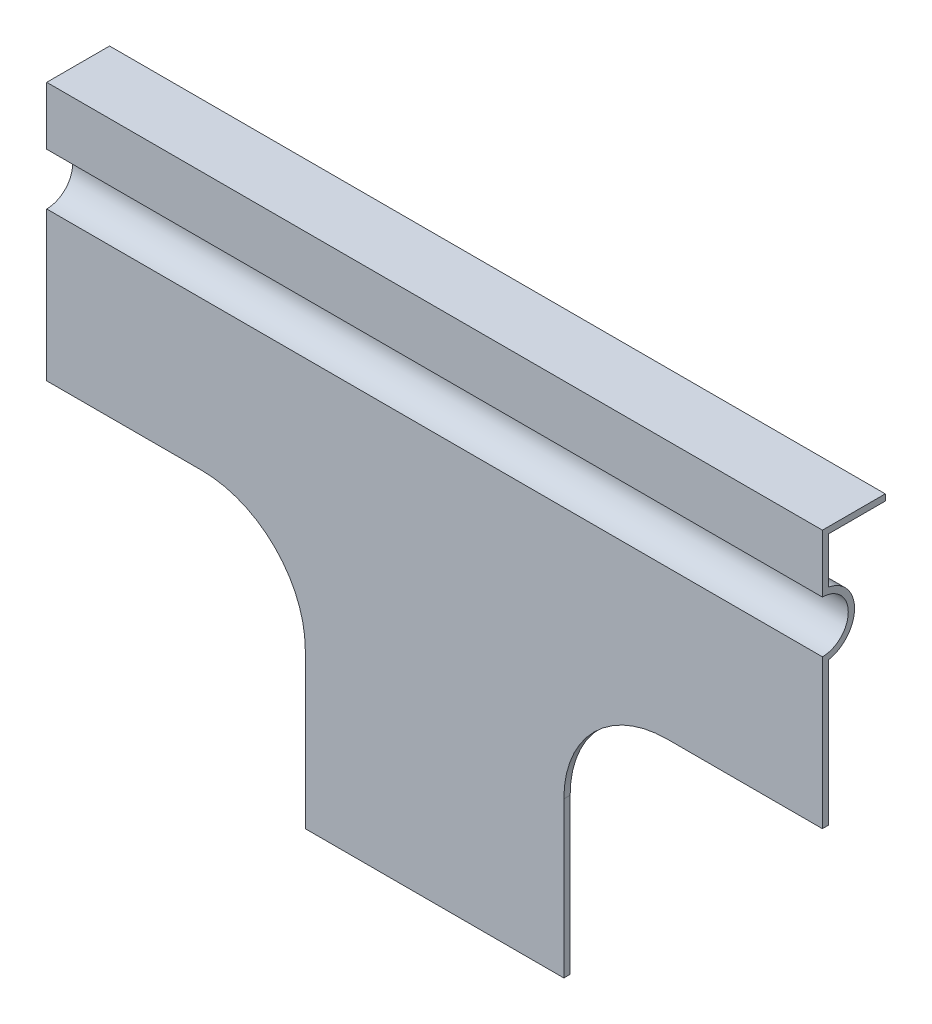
from build123d import *

# Parameters (mm, degrees)
EXTRUDE1_DEPTH      = 150
EXTRUDE2_DEPTH      = 161.951581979
EXTRUDE2_DEPTH_BACK = 161.951581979


with BuildPart() as part:
    # Sketch1 → Extrude1 (new body)
    with BuildSketch(Plane(origin=(0, 0, 0), x_dir=(0, 0, -1), z_dir=(1, 0, 0))):
        with BuildLine():
            Line((12.156994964, 42.6793004), (0, 42.6793004))
            Line((0, 42.6793004), (0, 31.4653004))
            ThreePointArc((0, 31.4653004), (5, 26.4653004), (0, 21.4653004))
            Line((0, 21.4653004), (0, -57.3206996))
            Line((0, -57.3206996), (1.214, -57.3206996))
            Line((1.214, -57.3206996), (1.214, 20.371040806))
            ThreePointArc((1.214, 20.371040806), (6.214, 26.4653004), (1.214, 32.559559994))
            Line((1.214, 32.559559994), (1.214, 41.4653004))
            Line((1.214, 41.4653004), (12.156994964, 41.4653004))
            Line((12.156994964, 41.4653004), (12.156994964, 42.6793004))
        make_face()
    extrude(amount=EXTRUDE1_DEPTH)

    # Sketch2 → Extrude2 (cut, two sides: drawn at the far end of the back side and taken through both)
    with BuildSketch(Plane(origin=(0, 0, -1.214), x_dir=(-1, 0, 0), z_dir=(0, 0, -1)).offset(-EXTRUDE2_DEPTH_BACK)):
        with BuildLine():
            Line((326.227766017, -7.3206996), (0, -7.3206996))
            Line((0, -7.3206996), (-30, -7.3206996))
            ThreePointArc((-30, -7.3206996), (-44.142135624, -13.178563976), (-50, -27.3206996))
            Line((-50, -27.3206996), (-50, -57.3206996))
            Line((-50, -57.3206996), (-100, -57.3206996))
            Line((-100, -57.3206996), (-100, -27.3206996))
            ThreePointArc((-100, -27.3206996), (-105.857864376, -13.178563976), (-120, -7.3206996))
            Line((-120, -7.3206996), (-150, -7.3206996))
            Line((-150, -7.3206996), (-476.227766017, -7.3206996))
            Line((-476.227766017, -7.3206996), (-476.227766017, -659.776231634))
            Line((-476.227766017, -659.776231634), (326.227766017, -659.776231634))
            Line((326.227766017, -659.776231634), (326.227766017, -7.3206996))
        make_face()
    extrude(amount=EXTRUDE2_DEPTH + EXTRUDE2_DEPTH_BACK, mode=Mode.SUBTRACT)


solid = part.part
